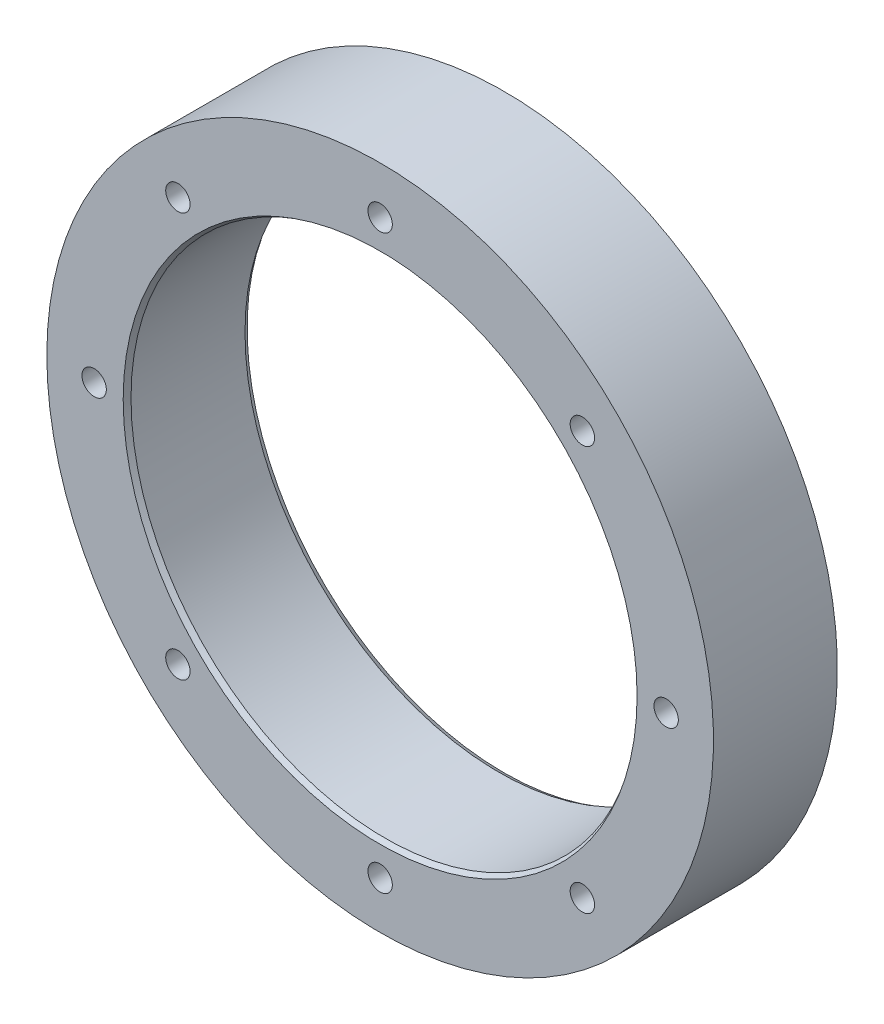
ISO-10303-21;
HEADER;
FILE_DESCRIPTION(('STEP AP214'),'2;1');
FILE_NAME('part.step','',(''),(''),'','','');
FILE_SCHEMA(('AUTOMOTIVE_DESIGN { 1 0 10303 214 1 1 1 1 }'));
ENDSEC;
DATA;
#1=APPLICATION_CONTEXT('core data for automotive mechanical design processes');
#2=APPLICATION_PROTOCOL_DEFINITION('international standard','automotive_design',2000,#1);
#3=PRODUCT_CONTEXT('',#1,'mechanical');
#4=PRODUCT('Part','Part','',(#3));
#5=PRODUCT_RELATED_PRODUCT_CATEGORY('part','',(#4));
#6=PRODUCT_DEFINITION_FORMATION('','',#4);
#7=PRODUCT_DEFINITION_CONTEXT('part definition',#1,'design');
#8=PRODUCT_DEFINITION('design','',#6,#7);
#9=PRODUCT_DEFINITION_SHAPE('','',#8);
#10=(LENGTH_UNIT() NAMED_UNIT(*) SI_UNIT(.MILLI.,.METRE.));
#11=(NAMED_UNIT(*) PLANE_ANGLE_UNIT() SI_UNIT($,.RADIAN.));
#12=(NAMED_UNIT(*) SI_UNIT($,.STERADIAN.) SOLID_ANGLE_UNIT());
#13=UNCERTAINTY_MEASURE_WITH_UNIT(LENGTH_MEASURE(1.E-05),#10,'distance_accuracy_value','');
#14=(GEOMETRIC_REPRESENTATION_CONTEXT(3) GLOBAL_UNCERTAINTY_ASSIGNED_CONTEXT((#13)) GLOBAL_UNIT_ASSIGNED_CONTEXT((#10,
#11,#12)) REPRESENTATION_CONTEXT('',''));
#15=CARTESIAN_POINT('',(0.,0.,0.));
#16=DIRECTION('',(0.,0.,1.));
#17=DIRECTION('',(1.,0.,0.));
#18=AXIS2_PLACEMENT_3D('',#15,#16,#17);
#19=CARTESIAN_POINT('',(-41.454135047,41.454135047,-13.4));
#20=DIRECTION('',(0.,0.,-1.));
#21=DIRECTION('',(0.,1.,0.));
#22=AXIS2_PLACEMENT_3D('',#19,#20,#21);
#23=CYLINDRICAL_SURFACE('',#22,2.5);
#24=CARTESIAN_POINT('',(-41.454135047,41.454135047,-13.4));
#25=DIRECTION('',(0.,0.,-1.));
#26=DIRECTION('',(0.,1.,0.));
#27=AXIS2_PLACEMENT_3D('',#24,#25,#26);
#28=CIRCLE('',#27,2.5);
#29=CARTESIAN_POINT('',(-41.454135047,43.954135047,-13.4));
#30=VERTEX_POINT('',#29);
#31=EDGE_CURVE('E31',#30,#30,#28,.T.);
#32=ORIENTED_EDGE('',*,*,#31,.F.);
#33=EDGE_LOOP('',(#32));
#34=FACE_BOUND('',#33,.T.);
#35=CARTESIAN_POINT('',(-41.454135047,41.454135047,-25.4));
#36=DIRECTION('',(0.,0.,-1.));
#37=DIRECTION('',(0.,1.,0.));
#38=AXIS2_PLACEMENT_3D('',#35,#36,#37);
#39=CIRCLE('',#38,2.5);
#40=CARTESIAN_POINT('',(-41.454135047,43.954135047,-25.4));
#41=VERTEX_POINT('',#40);
#42=EDGE_CURVE('E18',#41,#41,#39,.T.);
#43=ORIENTED_EDGE('',*,*,#42,.T.);
#44=EDGE_LOOP('',(#43));
#45=FACE_BOUND('',#44,.T.);
#46=ADVANCED_FACE('F14',(#34,#45),#23,.F.);
#47=CARTESIAN_POINT('',(-58.625,0.,-13.4));
#48=DIRECTION('',(0.,0.,-1.));
#49=DIRECTION('',(0.,1.,0.));
#50=AXIS2_PLACEMENT_3D('',#47,#48,#49);
#51=CYLINDRICAL_SURFACE('',#50,2.5);
#52=CARTESIAN_POINT('',(-58.625,0.,-13.4));
#53=DIRECTION('',(0.,0.,-1.));
#54=DIRECTION('',(-1.,0.,0.));
#55=AXIS2_PLACEMENT_3D('',#52,#53,#54);
#56=CIRCLE('',#55,2.5);
#57=CARTESIAN_POINT('',(-61.125,0.,-13.4));
#58=VERTEX_POINT('',#57);
#59=EDGE_CURVE('E113',#58,#58,#56,.T.);
#60=ORIENTED_EDGE('',*,*,#59,.F.);
#61=EDGE_LOOP('',(#60));
#62=FACE_BOUND('',#61,.T.);
#63=CARTESIAN_POINT('',(-58.625,0.,-25.4));
#64=DIRECTION('',(0.,0.,-1.));
#65=DIRECTION('',(0.,1.,0.));
#66=AXIS2_PLACEMENT_3D('',#63,#64,#65);
#67=CIRCLE('',#66,2.5);
#68=CARTESIAN_POINT('',(-58.625,2.5,-25.4));
#69=VERTEX_POINT('',#68);
#70=EDGE_CURVE('E87',#69,#69,#67,.T.);
#71=ORIENTED_EDGE('',*,*,#70,.T.);
#72=EDGE_LOOP('',(#71));
#73=FACE_BOUND('',#72,.T.);
#74=ADVANCED_FACE('F123',(#62,#73),#51,.F.);
#75=CARTESIAN_POINT('',(-41.454135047,-41.454135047,-13.4));
#76=DIRECTION('',(0.,0.,-1.));
#77=DIRECTION('',(0.,1.,0.));
#78=AXIS2_PLACEMENT_3D('',#75,#76,#77);
#79=CYLINDRICAL_SURFACE('',#78,2.5);
#80=CARTESIAN_POINT('',(-41.454135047,-41.454135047,-13.4));
#81=DIRECTION('',(0.,0.,-1.));
#82=DIRECTION('',(-1.,0.,0.));
#83=AXIS2_PLACEMENT_3D('',#80,#81,#82);
#84=CIRCLE('',#83,2.5);
#85=CARTESIAN_POINT('',(-43.954135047,-41.454135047,-13.4));
#86=VERTEX_POINT('',#85);
#87=EDGE_CURVE('E111',#86,#86,#84,.T.);
#88=ORIENTED_EDGE('',*,*,#87,.F.);
#89=EDGE_LOOP('',(#88));
#90=FACE_BOUND('',#89,.T.);
#91=CARTESIAN_POINT('',(-41.454135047,-41.454135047,-25.4));
#92=DIRECTION('',(0.,0.,-1.));
#93=DIRECTION('',(0.,1.,0.));
#94=AXIS2_PLACEMENT_3D('',#91,#92,#93);
#95=CIRCLE('',#94,2.5);
#96=CARTESIAN_POINT('',(-41.454135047,-38.954135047,-25.4));
#97=VERTEX_POINT('',#96);
#98=EDGE_CURVE('E85',#97,#97,#95,.T.);
#99=ORIENTED_EDGE('',*,*,#98,.T.);
#100=EDGE_LOOP('',(#99));
#101=FACE_BOUND('',#100,.T.);
#102=ADVANCED_FACE('F129',(#90,#101),#79,.F.);
#103=CARTESIAN_POINT('',(41.454135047,-41.454135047,-13.4));
#104=DIRECTION('',(0.,0.,-1.));
#105=DIRECTION('',(0.,1.,0.));
#106=AXIS2_PLACEMENT_3D('',#103,#104,#105);
#107=CYLINDRICAL_SURFACE('',#106,2.5);
#108=CARTESIAN_POINT('',(41.454135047,-41.454135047,-13.4));
#109=DIRECTION('',(0.,0.,-1.));
#110=DIRECTION('',(0.,1.,0.));
#111=AXIS2_PLACEMENT_3D('',#108,#109,#110);
#112=CIRCLE('',#111,2.5);
#113=CARTESIAN_POINT('',(41.454135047,-38.954135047,-13.4));
#114=VERTEX_POINT('',#113);
#115=EDGE_CURVE('E108',#114,#114,#112,.T.);
#116=ORIENTED_EDGE('',*,*,#115,.F.);
#117=EDGE_LOOP('',(#116));
#118=FACE_BOUND('',#117,.T.);
#119=CARTESIAN_POINT('',(41.454135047,-41.454135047,-25.4));
#120=DIRECTION('',(0.,0.,-1.));
#121=DIRECTION('',(0.,1.,0.));
#122=AXIS2_PLACEMENT_3D('',#119,#120,#121);
#123=CIRCLE('',#122,2.5);
#124=CARTESIAN_POINT('',(41.454135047,-38.954135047,-25.4));
#125=VERTEX_POINT('',#124);
#126=EDGE_CURVE('E82',#125,#125,#123,.T.);
#127=ORIENTED_EDGE('',*,*,#126,.T.);
#128=EDGE_LOOP('',(#127));
#129=FACE_BOUND('',#128,.T.);
#130=ADVANCED_FACE('F260',(#118,#129),#107,.F.);
#131=CARTESIAN_POINT('',(58.625,0.,-13.4));
#132=DIRECTION('',(0.,0.,-1.));
#133=DIRECTION('',(0.,1.,0.));
#134=AXIS2_PLACEMENT_3D('',#131,#132,#133);
#135=CYLINDRICAL_SURFACE('',#134,2.5);
#136=CARTESIAN_POINT('',(58.625,0.,-13.4));
#137=DIRECTION('',(0.,0.,-1.));
#138=DIRECTION('',(-1.,0.,0.));
#139=AXIS2_PLACEMENT_3D('',#136,#137,#138);
#140=CIRCLE('',#139,2.5);
#141=CARTESIAN_POINT('',(56.125,0.,-13.4));
#142=VERTEX_POINT('',#141);
#143=EDGE_CURVE('E101',#142,#142,#140,.T.);
#144=ORIENTED_EDGE('',*,*,#143,.F.);
#145=EDGE_LOOP('',(#144));
#146=FACE_BOUND('',#145,.T.);
#147=CARTESIAN_POINT('',(58.625,0.,-25.4));
#148=DIRECTION('',(0.,0.,-1.));
#149=DIRECTION('',(0.,1.,0.));
#150=AXIS2_PLACEMENT_3D('',#147,#148,#149);
#151=CIRCLE('',#150,2.5);
#152=CARTESIAN_POINT('',(58.625,2.50000000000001,-25.4));
#153=VERTEX_POINT('',#152);
#154=EDGE_CURVE('E79',#153,#153,#151,.T.);
#155=ORIENTED_EDGE('',*,*,#154,.T.);
#156=EDGE_LOOP('',(#155));
#157=FACE_BOUND('',#156,.T.);
#158=ADVANCED_FACE('F256',(#146,#157),#135,.F.);
#159=CARTESIAN_POINT('',(41.454135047,41.454135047,-13.4));
#160=DIRECTION('',(0.,0.,-1.));
#161=DIRECTION('',(0.,1.,0.));
#162=AXIS2_PLACEMENT_3D('',#159,#160,#161);
#163=CYLINDRICAL_SURFACE('',#162,2.5);
#164=CARTESIAN_POINT('',(41.454135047,41.454135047,-13.4));
#165=DIRECTION('',(0.,0.,-1.));
#166=DIRECTION('',(-1.,0.,0.));
#167=AXIS2_PLACEMENT_3D('',#164,#165,#166);
#168=CIRCLE('',#167,2.5);
#169=CARTESIAN_POINT('',(38.954135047,41.454135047,-13.4));
#170=VERTEX_POINT('',#169);
#171=EDGE_CURVE('E96',#170,#170,#168,.T.);
#172=ORIENTED_EDGE('',*,*,#171,.F.);
#173=EDGE_LOOP('',(#172));
#174=FACE_BOUND('',#173,.T.);
#175=CARTESIAN_POINT('',(41.454135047,41.454135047,-25.4));
#176=DIRECTION('',(0.,0.,-1.));
#177=DIRECTION('',(0.,1.,0.));
#178=AXIS2_PLACEMENT_3D('',#175,#176,#177);
#179=CIRCLE('',#178,2.5);
#180=CARTESIAN_POINT('',(41.454135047,43.954135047,-25.4));
#181=VERTEX_POINT('',#180);
#182=EDGE_CURVE('E76',#181,#181,#179,.T.);
#183=ORIENTED_EDGE('',*,*,#182,.T.);
#184=EDGE_LOOP('',(#183));
#185=FACE_BOUND('',#184,.T.);
#186=ADVANCED_FACE('F252',(#174,#185),#163,.F.);
#187=CARTESIAN_POINT('',(0.,58.625,-13.4));
#188=DIRECTION('',(0.,0.,-1.));
#189=DIRECTION('',(-1.,0.,0.));
#190=AXIS2_PLACEMENT_3D('',#187,#188,#189);
#191=CYLINDRICAL_SURFACE('',#190,2.5);
#192=CARTESIAN_POINT('',(0.,58.625,-13.4));
#193=DIRECTION('',(0.,0.,-1.));
#194=DIRECTION('',(-1.,0.,0.));
#195=AXIS2_PLACEMENT_3D('',#192,#193,#194);
#196=CIRCLE('',#195,2.5);
#197=CARTESIAN_POINT('',(-2.5,58.625,-13.4));
#198=VERTEX_POINT('',#197);
#199=EDGE_CURVE('E92',#198,#198,#196,.T.);
#200=ORIENTED_EDGE('',*,*,#199,.F.);
#201=EDGE_LOOP('',(#200));
#202=FACE_BOUND('',#201,.T.);
#203=CARTESIAN_POINT('',(0.,58.625,-25.4));
#204=DIRECTION('',(0.,0.,-1.));
#205=DIRECTION('',(-1.,0.,0.));
#206=AXIS2_PLACEMENT_3D('',#203,#204,#205);
#207=CIRCLE('',#206,2.5);
#208=CARTESIAN_POINT('',(-2.49999999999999,58.625,-25.4));
#209=VERTEX_POINT('',#208);
#210=EDGE_CURVE('E73',#209,#209,#207,.T.);
#211=ORIENTED_EDGE('',*,*,#210,.T.);
#212=EDGE_LOOP('',(#211));
#213=FACE_BOUND('',#212,.T.);
#214=ADVANCED_FACE('F248',(#202,#213),#191,.F.);
#215=CARTESIAN_POINT('',(-41.454135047,41.454135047,-12.7));
#216=DIRECTION('',(0.,0.,-1.));
#217=DIRECTION('',(-1.,0.,0.));
#218=AXIS2_PLACEMENT_3D('',#215,#216,#217);
#219=CONICAL_SURFACE('',#218,1.335004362,1.02974425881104);
#220=CARTESIAN_POINT('',(-41.454135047,41.454135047,-12.6999999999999));
#221=DIRECTION('',(0.,0.,1.));
#222=DIRECTION('',(1.,0.,0.));
#223=AXIS2_PLACEMENT_3D('',#220,#221,#222);
#224=CIRCLE('',#223,1.335004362);
#225=CARTESIAN_POINT('',(-40.119130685,41.454135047,-12.7));
#226=VERTEX_POINT('',#225);
#227=EDGE_CURVE('E72',#226,#226,#224,.F.);
#228=ORIENTED_EDGE('',*,*,#227,.F.);
#229=EDGE_LOOP('',(#228));
#230=FACE_BOUND('',#229,.T.);
#231=ORIENTED_EDGE('',*,*,#31,.T.);
#232=EDGE_LOOP('',(#231));
#233=FACE_BOUND('',#232,.T.);
#234=ADVANCED_FACE('F120',(#230,#233),#219,.F.);
#235=CARTESIAN_POINT('',(-58.625,0.,-12.7));
#236=DIRECTION('',(0.,0.,-1.));
#237=DIRECTION('',(-1.,0.,0.));
#238=AXIS2_PLACEMENT_3D('',#235,#236,#237);
#239=CONICAL_SURFACE('',#238,1.33500436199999,1.02974425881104);
#240=ORIENTED_EDGE('',*,*,#59,.T.);
#241=EDGE_LOOP('',(#240));
#242=FACE_BOUND('',#241,.T.);
#243=CARTESIAN_POINT('',(-58.625,0.,-12.6999999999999));
#244=DIRECTION('',(0.,0.,1.));
#245=DIRECTION('',(1.,0.,0.));
#246=AXIS2_PLACEMENT_3D('',#243,#244,#245);
#247=CIRCLE('',#246,1.335004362);
#248=CARTESIAN_POINT('',(-57.289995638,0.,-12.7));
#249=VERTEX_POINT('',#248);
#250=EDGE_CURVE('E338',#249,#249,#247,.F.);
#251=ORIENTED_EDGE('',*,*,#250,.F.);
#252=EDGE_LOOP('',(#251));
#253=FACE_BOUND('',#252,.T.);
#254=ADVANCED_FACE('F242',(#242,#253),#239,.F.);
#255=CARTESIAN_POINT('',(-41.454135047,-41.454135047,-12.7));
#256=DIRECTION('',(0.,0.,-1.));
#257=DIRECTION('',(-1.,0.,0.));
#258=AXIS2_PLACEMENT_3D('',#255,#256,#257);
#259=CONICAL_SURFACE('',#258,1.335004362,1.02974425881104);
#260=ORIENTED_EDGE('',*,*,#87,.T.);
#261=EDGE_LOOP('',(#260));
#262=FACE_BOUND('',#261,.T.);
#263=CARTESIAN_POINT('',(-41.454135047,-41.454135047,-12.6999999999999));
#264=DIRECTION('',(0.,0.,1.));
#265=DIRECTION('',(0.,-1.,0.));
#266=AXIS2_PLACEMENT_3D('',#263,#264,#265);
#267=CIRCLE('',#266,1.335004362);
#268=CARTESIAN_POINT('',(-41.454135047,-42.789139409,-12.7));
#269=VERTEX_POINT('',#268);
#270=EDGE_CURVE('E336',#269,#269,#267,.F.);
#271=ORIENTED_EDGE('',*,*,#270,.F.);
#272=EDGE_LOOP('',(#271));
#273=FACE_BOUND('',#272,.T.);
#274=ADVANCED_FACE('F238',(#262,#273),#259,.F.);
#275=CARTESIAN_POINT('',(41.454135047,-41.454135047,-12.7));
#276=DIRECTION('',(0.,0.,-1.));
#277=DIRECTION('',(-1.,0.,0.));
#278=AXIS2_PLACEMENT_3D('',#275,#276,#277);
#279=CONICAL_SURFACE('',#278,1.335004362,1.02974425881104);
#280=CARTESIAN_POINT('',(41.454135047,-41.454135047,-12.6999999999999));
#281=DIRECTION('',(0.,0.,1.));
#282=DIRECTION('',(1.,0.,0.));
#283=AXIS2_PLACEMENT_3D('',#280,#281,#282);
#284=CIRCLE('',#283,1.335004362);
#285=CARTESIAN_POINT('',(42.789139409,-41.454135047,-12.7));
#286=VERTEX_POINT('',#285);
#287=EDGE_CURVE('E333',#286,#286,#284,.F.);
#288=ORIENTED_EDGE('',*,*,#287,.F.);
#289=EDGE_LOOP('',(#288));
#290=FACE_BOUND('',#289,.T.);
#291=ORIENTED_EDGE('',*,*,#115,.T.);
#292=EDGE_LOOP('',(#291));
#293=FACE_BOUND('',#292,.T.);
#294=ADVANCED_FACE('F234',(#290,#293),#279,.F.);
#295=CARTESIAN_POINT('',(58.625,0.,-12.7));
#296=DIRECTION('',(0.,0.,-1.));
#297=DIRECTION('',(-1.,0.,0.));
#298=AXIS2_PLACEMENT_3D('',#295,#296,#297);
#299=CONICAL_SURFACE('',#298,1.335004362,1.02974425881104);
#300=ORIENTED_EDGE('',*,*,#143,.T.);
#301=EDGE_LOOP('',(#300));
#302=FACE_BOUND('',#301,.T.);
#303=CARTESIAN_POINT('',(58.625,0.,-12.6999999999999));
#304=DIRECTION('',(0.,0.,1.));
#305=DIRECTION('',(1.,0.,0.));
#306=AXIS2_PLACEMENT_3D('',#303,#304,#305);
#307=CIRCLE('',#306,1.33500436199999);
#308=CARTESIAN_POINT('',(59.960004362,0.,-12.7));
#309=VERTEX_POINT('',#308);
#310=EDGE_CURVE('E330',#309,#309,#307,.F.);
#311=ORIENTED_EDGE('',*,*,#310,.F.);
#312=EDGE_LOOP('',(#311));
#313=FACE_BOUND('',#312,.T.);
#314=ADVANCED_FACE('F230',(#302,#313),#299,.F.);
#315=CARTESIAN_POINT('',(41.454135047,41.454135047,-12.7));
#316=DIRECTION('',(0.,0.,-1.));
#317=DIRECTION('',(-1.,0.,0.));
#318=AXIS2_PLACEMENT_3D('',#315,#316,#317);
#319=CONICAL_SURFACE('',#318,1.335004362,1.02974425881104);
#320=ORIENTED_EDGE('',*,*,#171,.T.);
#321=EDGE_LOOP('',(#320));
#322=FACE_BOUND('',#321,.T.);
#323=CARTESIAN_POINT('',(41.454135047,41.454135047,-12.6999999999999));
#324=DIRECTION('',(0.,0.,1.));
#325=DIRECTION('',(0.,-1.,0.));
#326=AXIS2_PLACEMENT_3D('',#323,#324,#325);
#327=CIRCLE('',#326,1.335004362);
#328=CARTESIAN_POINT('',(41.454135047,40.119130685,-12.7));
#329=VERTEX_POINT('',#328);
#330=EDGE_CURVE('E327',#329,#329,#327,.F.);
#331=ORIENTED_EDGE('',*,*,#330,.F.);
#332=EDGE_LOOP('',(#331));
#333=FACE_BOUND('',#332,.T.);
#334=ADVANCED_FACE('F227',(#322,#333),#319,.F.);
#335=CARTESIAN_POINT('',(0.,58.625,-12.7));
#336=DIRECTION('',(0.,0.,-1.));
#337=DIRECTION('',(-1.,0.,0.));
#338=AXIS2_PLACEMENT_3D('',#335,#336,#337);
#339=CONICAL_SURFACE('',#338,1.335004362,1.02974425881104);
#340=ORIENTED_EDGE('',*,*,#199,.T.);
#341=EDGE_LOOP('',(#340));
#342=FACE_BOUND('',#341,.T.);
#343=CARTESIAN_POINT('',(0.,58.625,-12.6999999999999));
#344=DIRECTION('',(0.,0.,1.));
#345=DIRECTION('',(0.,-1.,0.));
#346=AXIS2_PLACEMENT_3D('',#343,#344,#345);
#347=CIRCLE('',#346,1.335004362);
#348=CARTESIAN_POINT('',(0.,57.289995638,-12.7));
#349=VERTEX_POINT('',#348);
#350=EDGE_CURVE('E324',#349,#349,#347,.F.);
#351=ORIENTED_EDGE('',*,*,#350,.F.);
#352=EDGE_LOOP('',(#351));
#353=FACE_BOUND('',#352,.T.);
#354=ADVANCED_FACE('F223',(#342,#353),#339,.F.);
#355=CARTESIAN_POINT('',(0.,0.,-24.383981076));
#356=DIRECTION('',(0.,0.,-1.));
#357=DIRECTION('',(0.,1.,0.));
#358=AXIS2_PLACEMENT_3D('',#355,#356,#357);
#359=CONICAL_SURFACE('',#358,52.085,0.52359886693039);
#360=CARTESIAN_POINT('',(0.,0.,-25.4000000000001));
#361=DIRECTION('',(0.,0.,-1.));
#362=DIRECTION('',(0.,1.,0.));
#363=AXIS2_PLACEMENT_3D('',#360,#361,#362);
#364=CIRCLE('',#363,52.6715989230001);
#365=CARTESIAN_POINT('',(0.,52.6715989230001,-25.4000000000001));
#366=VERTEX_POINT('',#365);
#367=EDGE_CURVE('E69',#366,#366,#364,.T.);
#368=ORIENTED_EDGE('',*,*,#367,.T.);
#369=EDGE_LOOP('',(#368));
#370=FACE_BOUND('',#369,.T.);
#371=CARTESIAN_POINT('',(0.,0.,-24.383981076));
#372=DIRECTION('',(0.,0.,-1.));
#373=DIRECTION('',(-1.,0.,0.));
#374=AXIS2_PLACEMENT_3D('',#371,#372,#373);
#375=CIRCLE('',#374,52.085);
#376=CARTESIAN_POINT('',(-52.085,0.,-24.383981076));
#377=VERTEX_POINT('',#376);
#378=EDGE_CURVE('E68',#377,#377,#375,.T.);
#379=ORIENTED_EDGE('',*,*,#378,.F.);
#380=EDGE_LOOP('',(#379));
#381=FACE_BOUND('',#380,.T.);
#382=ADVANCED_FACE('F220',(#370,#381),#359,.F.);
#383=CARTESIAN_POINT('',(69.1449,-69.1449,-25.4));
#384=DIRECTION('',(0.,0.,1.));
#385=DIRECTION('',(0.,1.,0.));
#386=AXIS2_PLACEMENT_3D('',#383,#384,#385);
#387=PLANE('',#386);
#388=ORIENTED_EDGE('',*,*,#367,.F.);
#389=EDGE_LOOP('',(#388));
#390=FACE_BOUND('',#389,.T.);
#391=ORIENTED_EDGE('',*,*,#210,.F.);
#392=EDGE_LOOP('',(#391));
#393=FACE_BOUND('',#392,.T.);
#394=ORIENTED_EDGE('',*,*,#182,.F.);
#395=EDGE_LOOP('',(#394));
#396=FACE_BOUND('',#395,.T.);
#397=ORIENTED_EDGE('',*,*,#154,.F.);
#398=EDGE_LOOP('',(#397));
#399=FACE_BOUND('',#398,.T.);
#400=ORIENTED_EDGE('',*,*,#126,.F.);
#401=EDGE_LOOP('',(#400));
#402=FACE_BOUND('',#401,.T.);
#403=CARTESIAN_POINT('',(0.,-58.625,-25.4));
#404=DIRECTION('',(0.,0.,-1.));
#405=DIRECTION('',(-1.,0.,0.));
#406=AXIS2_PLACEMENT_3D('',#403,#404,#405);
#407=CIRCLE('',#406,2.5);
#408=CARTESIAN_POINT('',(-2.5,-58.625,-25.4));
#409=VERTEX_POINT('',#408);
#410=EDGE_CURVE('E65',#409,#409,#407,.T.);
#411=ORIENTED_EDGE('',*,*,#410,.F.);
#412=EDGE_LOOP('',(#411));
#413=FACE_BOUND('',#412,.T.);
#414=ORIENTED_EDGE('',*,*,#98,.F.);
#415=EDGE_LOOP('',(#414));
#416=FACE_BOUND('',#415,.T.);
#417=ORIENTED_EDGE('',*,*,#70,.F.);
#418=EDGE_LOOP('',(#417));
#419=FACE_BOUND('',#418,.T.);
#420=ORIENTED_EDGE('',*,*,#42,.F.);
#421=EDGE_LOOP('',(#420));
#422=FACE_BOUND('',#421,.T.);
#423=CARTESIAN_POINT('',(0.,0.,-25.4));
#424=DIRECTION('',(0.,0.,-1.));
#425=DIRECTION('',(-1.,0.,0.));
#426=AXIS2_PLACEMENT_3D('',#423,#424,#425);
#427=CIRCLE('',#426,68.325);
#428=CARTESIAN_POINT('',(-68.325,0.,-25.4));
#429=VERTEX_POINT('',#428);
#430=EDGE_CURVE('E61',#429,#429,#427,.T.);
#431=ORIENTED_EDGE('',*,*,#430,.T.);
#432=EDGE_LOOP('',(#431));
#433=FACE_BOUND('',#432,.T.);
#434=ADVANCED_FACE('F218',(#390,#393,#396,#399,#402,#413,#416,#419,#422,#433),#387,.F.);
#435=CARTESIAN_POINT('',(-41.454135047,41.454135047,-12.7));
#436=DIRECTION('',(0.,0.,1.));
#437=DIRECTION('',(1.,0.,0.));
#438=AXIS2_PLACEMENT_3D('',#435,#436,#437);
#439=CONICAL_SURFACE('',#438,1.335004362,1.02974425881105);
#440=CARTESIAN_POINT('',(-41.454135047,41.454135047,-12.));
#441=DIRECTION('',(0.,0.,1.));
#442=DIRECTION('',(1.,0.,0.));
#443=AXIS2_PLACEMENT_3D('',#440,#441,#442);
#444=CIRCLE('',#443,2.5);
#445=CARTESIAN_POINT('',(-38.954135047,41.454135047,-12.));
#446=VERTEX_POINT('',#445);
#447=EDGE_CURVE('E64',#446,#446,#444,.F.);
#448=ORIENTED_EDGE('',*,*,#447,.F.);
#449=EDGE_LOOP('',(#448));
#450=FACE_BOUND('',#449,.T.);
#451=ORIENTED_EDGE('',*,*,#227,.T.);
#452=EDGE_LOOP('',(#451));
#453=FACE_BOUND('',#452,.T.);
#454=ADVANCED_FACE('F214',(#450,#453),#439,.F.);
#455=CARTESIAN_POINT('',(-58.625,0.,-12.7));
#456=DIRECTION('',(0.,0.,1.));
#457=DIRECTION('',(1.,0.,0.));
#458=AXIS2_PLACEMENT_3D('',#455,#456,#457);
#459=CONICAL_SURFACE('',#458,1.335004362,1.02974425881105);
#460=CARTESIAN_POINT('',(-58.625,0.,-12.));
#461=DIRECTION('',(0.,0.,1.));
#462=DIRECTION('',(1.,0.,0.));
#463=AXIS2_PLACEMENT_3D('',#460,#461,#462);
#464=CIRCLE('',#463,2.5);
#465=CARTESIAN_POINT('',(-56.125,0.,-12.));
#466=VERTEX_POINT('',#465);
#467=EDGE_CURVE('E317',#466,#466,#464,.F.);
#468=ORIENTED_EDGE('',*,*,#467,.F.);
#469=EDGE_LOOP('',(#468));
#470=FACE_BOUND('',#469,.T.);
#471=ORIENTED_EDGE('',*,*,#250,.T.);
#472=EDGE_LOOP('',(#471));
#473=FACE_BOUND('',#472,.T.);
#474=ADVANCED_FACE('F210',(#470,#473),#459,.F.);
#475=CARTESIAN_POINT('',(-41.454135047,-41.454135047,-12.7));
#476=DIRECTION('',(0.,0.,1.));
#477=DIRECTION('',(1.,0.,0.));
#478=AXIS2_PLACEMENT_3D('',#475,#476,#477);
#479=CONICAL_SURFACE('',#478,1.335004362,1.02974425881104);
#480=CARTESIAN_POINT('',(-41.454135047,-41.454135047,-12.));
#481=DIRECTION('',(0.,0.,1.));
#482=DIRECTION('',(0.,-1.,0.));
#483=AXIS2_PLACEMENT_3D('',#480,#481,#482);
#484=CIRCLE('',#483,2.5);
#485=CARTESIAN_POINT('',(-41.454135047,-43.954135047,-12.));
#486=VERTEX_POINT('',#485);
#487=EDGE_CURVE('E314',#486,#486,#484,.F.);
#488=ORIENTED_EDGE('',*,*,#487,.F.);
#489=EDGE_LOOP('',(#488));
#490=FACE_BOUND('',#489,.T.);
#491=ORIENTED_EDGE('',*,*,#270,.T.);
#492=EDGE_LOOP('',(#491));
#493=FACE_BOUND('',#492,.T.);
#494=ADVANCED_FACE('F206',(#490,#493),#479,.F.);
#495=CARTESIAN_POINT('',(41.454135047,-41.454135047,-12.7));
#496=DIRECTION('',(0.,0.,1.));
#497=DIRECTION('',(1.,0.,0.));
#498=AXIS2_PLACEMENT_3D('',#495,#496,#497);
#499=CONICAL_SURFACE('',#498,1.335004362,1.02974425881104);
#500=CARTESIAN_POINT('',(41.454135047,-41.454135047,-12.));
#501=DIRECTION('',(0.,0.,1.));
#502=DIRECTION('',(1.,0.,0.));
#503=AXIS2_PLACEMENT_3D('',#500,#501,#502);
#504=CIRCLE('',#503,2.5);
#505=CARTESIAN_POINT('',(43.954135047,-41.454135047,-12.));
#506=VERTEX_POINT('',#505);
#507=EDGE_CURVE('E311',#506,#506,#504,.F.);
#508=ORIENTED_EDGE('',*,*,#507,.F.);
#509=EDGE_LOOP('',(#508));
#510=FACE_BOUND('',#509,.T.);
#511=ORIENTED_EDGE('',*,*,#287,.T.);
#512=EDGE_LOOP('',(#511));
#513=FACE_BOUND('',#512,.T.);
#514=ADVANCED_FACE('F202',(#510,#513),#499,.F.);
#515=CARTESIAN_POINT('',(58.625,0.,-12.7));
#516=DIRECTION('',(0.,0.,1.));
#517=DIRECTION('',(1.,0.,0.));
#518=AXIS2_PLACEMENT_3D('',#515,#516,#517);
#519=CONICAL_SURFACE('',#518,1.33500436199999,1.02974425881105);
#520=CARTESIAN_POINT('',(58.625,0.,-12.));
#521=DIRECTION('',(0.,0.,1.));
#522=DIRECTION('',(1.,0.,0.));
#523=AXIS2_PLACEMENT_3D('',#520,#521,#522);
#524=CIRCLE('',#523,2.5);
#525=CARTESIAN_POINT('',(61.125,0.,-12.));
#526=VERTEX_POINT('',#525);
#527=EDGE_CURVE('E308',#526,#526,#524,.F.);
#528=ORIENTED_EDGE('',*,*,#527,.F.);
#529=EDGE_LOOP('',(#528));
#530=FACE_BOUND('',#529,.T.);
#531=ORIENTED_EDGE('',*,*,#310,.T.);
#532=EDGE_LOOP('',(#531));
#533=FACE_BOUND('',#532,.T.);
#534=ADVANCED_FACE('F198',(#530,#533),#519,.F.);
#535=CARTESIAN_POINT('',(41.454135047,41.454135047,-12.7));
#536=DIRECTION('',(0.,0.,1.));
#537=DIRECTION('',(1.,0.,0.));
#538=AXIS2_PLACEMENT_3D('',#535,#536,#537);
#539=CONICAL_SURFACE('',#538,1.335004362,1.02974425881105);
#540=CARTESIAN_POINT('',(41.454135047,41.454135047,-12.));
#541=DIRECTION('',(0.,0.,1.));
#542=DIRECTION('',(0.,-1.,0.));
#543=AXIS2_PLACEMENT_3D('',#540,#541,#542);
#544=CIRCLE('',#543,2.5);
#545=CARTESIAN_POINT('',(41.454135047,38.954135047,-12.));
#546=VERTEX_POINT('',#545);
#547=EDGE_CURVE('E305',#546,#546,#544,.F.);
#548=ORIENTED_EDGE('',*,*,#547,.F.);
#549=EDGE_LOOP('',(#548));
#550=FACE_BOUND('',#549,.T.);
#551=ORIENTED_EDGE('',*,*,#330,.T.);
#552=EDGE_LOOP('',(#551));
#553=FACE_BOUND('',#552,.T.);
#554=ADVANCED_FACE('F194',(#550,#553),#539,.F.);
#555=CARTESIAN_POINT('',(0.,58.625,-12.7));
#556=DIRECTION('',(0.,0.,1.));
#557=DIRECTION('',(1.,0.,0.));
#558=AXIS2_PLACEMENT_3D('',#555,#556,#557);
#559=CONICAL_SURFACE('',#558,1.335004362,1.02974425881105);
#560=ORIENTED_EDGE('',*,*,#350,.T.);
#561=EDGE_LOOP('',(#560));
#562=FACE_BOUND('',#561,.T.);
#563=CARTESIAN_POINT('',(0.,58.625,-12.));
#564=DIRECTION('',(0.,0.,1.));
#565=DIRECTION('',(1.,0.,0.));
#566=AXIS2_PLACEMENT_3D('',#563,#564,#565);
#567=CIRCLE('',#566,2.5);
#568=CARTESIAN_POINT('',(2.5,58.625,-12.));
#569=VERTEX_POINT('',#568);
#570=EDGE_CURVE('E299',#569,#569,#567,.F.);
#571=ORIENTED_EDGE('',*,*,#570,.F.);
#572=EDGE_LOOP('',(#571));
#573=FACE_BOUND('',#572,.T.);
#574=ADVANCED_FACE('F190',(#562,#573),#559,.F.);
#575=CARTESIAN_POINT('',(0.,0.,-1.016021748));
#576=DIRECTION('',(0.,0.,-1.));
#577=DIRECTION('',(-1.,0.,0.));
#578=AXIS2_PLACEMENT_3D('',#575,#576,#577);
#579=CYLINDRICAL_SURFACE('',#578,52.085);
#580=ORIENTED_EDGE('',*,*,#378,.T.);
#581=EDGE_LOOP('',(#580));
#582=FACE_BOUND('',#581,.T.);
#583=CARTESIAN_POINT('',(0.,0.,-1.01602174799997));
#584=DIRECTION('',(0.,0.,1.));
#585=DIRECTION('',(1.,0.,0.));
#586=AXIS2_PLACEMENT_3D('',#583,#584,#585);
#587=CIRCLE('',#586,52.085);
#588=CARTESIAN_POINT('',(52.085,0.,-1.016021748));
#589=VERTEX_POINT('',#588);
#590=EDGE_CURVE('E296',#589,#589,#587,.F.);
#591=ORIENTED_EDGE('',*,*,#590,.F.);
#592=EDGE_LOOP('',(#591));
#593=FACE_BOUND('',#592,.T.);
#594=ADVANCED_FACE('F186',(#582,#593),#579,.F.);
#595=CARTESIAN_POINT('',(0.,-58.625,-13.4));
#596=DIRECTION('',(0.,0.,-1.));
#597=DIRECTION('',(-1.,0.,0.));
#598=AXIS2_PLACEMENT_3D('',#595,#596,#597);
#599=CYLINDRICAL_SURFACE('',#598,2.5);
#600=ORIENTED_EDGE('',*,*,#410,.T.);
#601=EDGE_LOOP('',(#600));
#602=FACE_BOUND('',#601,.T.);
#603=CARTESIAN_POINT('',(0.,-58.625,-13.4));
#604=DIRECTION('',(0.,0.,-1.));
#605=DIRECTION('',(-1.,0.,0.));
#606=AXIS2_PLACEMENT_3D('',#603,#604,#605);
#607=CIRCLE('',#606,2.5);
#608=CARTESIAN_POINT('',(-2.5,-58.625,-13.4));
#609=VERTEX_POINT('',#608);
#610=EDGE_CURVE('E60',#609,#609,#607,.T.);
#611=ORIENTED_EDGE('',*,*,#610,.F.);
#612=EDGE_LOOP('',(#611));
#613=FACE_BOUND('',#612,.T.);
#614=ADVANCED_FACE('F182',(#602,#613),#599,.F.);
#615=CARTESIAN_POINT('',(0.,0.,0.));
#616=DIRECTION('',(0.,0.,-1.));
#617=DIRECTION('',(-1.,0.,0.));
#618=AXIS2_PLACEMENT_3D('',#615,#616,#617);
#619=CYLINDRICAL_SURFACE('',#618,68.325);
#620=CARTESIAN_POINT('',(0.,0.,0.));
#621=DIRECTION('',(0.,0.,-1.));
#622=DIRECTION('',(-1.,0.,0.));
#623=AXIS2_PLACEMENT_3D('',#620,#621,#622);
#624=CIRCLE('',#623,68.325);
#625=CARTESIAN_POINT('',(-68.325,0.,0.));
#626=VERTEX_POINT('',#625);
#627=EDGE_CURVE('E57',#626,#626,#624,.F.);
#628=ORIENTED_EDGE('',*,*,#627,.F.);
#629=EDGE_LOOP('',(#628));
#630=FACE_BOUND('',#629,.T.);
#631=ORIENTED_EDGE('',*,*,#430,.F.);
#632=EDGE_LOOP('',(#631));
#633=FACE_BOUND('',#632,.T.);
#634=ADVANCED_FACE('F178',(#630,#633),#619,.T.);
#635=CARTESIAN_POINT('',(-41.454135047,41.454135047,-12.));
#636=DIRECTION('',(0.,0.,1.));
#637=DIRECTION('',(1.,0.,0.));
#638=AXIS2_PLACEMENT_3D('',#635,#636,#637);
#639=CYLINDRICAL_SURFACE('',#638,2.5);
#640=CARTESIAN_POINT('',(-41.454135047,41.454135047,0.));
#641=DIRECTION('',(0.,0.,1.));
#642=DIRECTION('',(1.,0.,0.));
#643=AXIS2_PLACEMENT_3D('',#640,#641,#642);
#644=CIRCLE('',#643,2.5);
#645=CARTESIAN_POINT('',(-38.954135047,41.454135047,0.));
#646=VERTEX_POINT('',#645);
#647=EDGE_CURVE('E54',#646,#646,#644,.F.);
#648=ORIENTED_EDGE('',*,*,#647,.F.);
#649=EDGE_LOOP('',(#648));
#650=FACE_BOUND('',#649,.T.);
#651=ORIENTED_EDGE('',*,*,#447,.T.);
#652=EDGE_LOOP('',(#651));
#653=FACE_BOUND('',#652,.T.);
#654=ADVANCED_FACE('F174',(#650,#653),#639,.F.);
#655=CARTESIAN_POINT('',(-58.625,0.,-12.));
#656=DIRECTION('',(0.,0.,1.));
#657=DIRECTION('',(1.,0.,0.));
#658=AXIS2_PLACEMENT_3D('',#655,#656,#657);
#659=CYLINDRICAL_SURFACE('',#658,2.5);
#660=CARTESIAN_POINT('',(-58.625,0.,0.));
#661=DIRECTION('',(0.,0.,1.));
#662=DIRECTION('',(1.,0.,0.));
#663=AXIS2_PLACEMENT_3D('',#660,#661,#662);
#664=CIRCLE('',#663,2.5);
#665=CARTESIAN_POINT('',(-56.125,0.,0.));
#666=VERTEX_POINT('',#665);
#667=EDGE_CURVE('E51',#666,#666,#664,.F.);
#668=ORIENTED_EDGE('',*,*,#667,.F.);
#669=EDGE_LOOP('',(#668));
#670=FACE_BOUND('',#669,.T.);
#671=ORIENTED_EDGE('',*,*,#467,.T.);
#672=EDGE_LOOP('',(#671));
#673=FACE_BOUND('',#672,.T.);
#674=ADVANCED_FACE('F170',(#670,#673),#659,.F.);
#675=CARTESIAN_POINT('',(-41.454135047,-41.454135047,-12.));
#676=DIRECTION('',(0.,0.,1.));
#677=DIRECTION('',(1.,0.,0.));
#678=AXIS2_PLACEMENT_3D('',#675,#676,#677);
#679=CYLINDRICAL_SURFACE('',#678,2.5);
#680=CARTESIAN_POINT('',(-41.454135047,-41.454135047,0.));
#681=DIRECTION('',(0.,0.,1.));
#682=DIRECTION('',(1.,0.,0.));
#683=AXIS2_PLACEMENT_3D('',#680,#681,#682);
#684=CIRCLE('',#683,2.5);
#685=CARTESIAN_POINT('',(-38.954135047,-41.454135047,0.));
#686=VERTEX_POINT('',#685);
#687=EDGE_CURVE('E48',#686,#686,#684,.F.);
#688=ORIENTED_EDGE('',*,*,#687,.F.);
#689=EDGE_LOOP('',(#688));
#690=FACE_BOUND('',#689,.T.);
#691=ORIENTED_EDGE('',*,*,#487,.T.);
#692=EDGE_LOOP('',(#691));
#693=FACE_BOUND('',#692,.T.);
#694=ADVANCED_FACE('F166',(#690,#693),#679,.F.);
#695=CARTESIAN_POINT('',(41.454135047,-41.454135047,-12.));
#696=DIRECTION('',(0.,0.,1.));
#697=DIRECTION('',(1.,0.,0.));
#698=AXIS2_PLACEMENT_3D('',#695,#696,#697);
#699=CYLINDRICAL_SURFACE('',#698,2.5);
#700=CARTESIAN_POINT('',(41.454135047,-41.454135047,0.));
#701=DIRECTION('',(0.,0.,1.));
#702=DIRECTION('',(1.,0.,0.));
#703=AXIS2_PLACEMENT_3D('',#700,#701,#702);
#704=CIRCLE('',#703,2.5);
#705=CARTESIAN_POINT('',(43.954135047,-41.454135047,0.));
#706=VERTEX_POINT('',#705);
#707=EDGE_CURVE('E45',#706,#706,#704,.F.);
#708=ORIENTED_EDGE('',*,*,#707,.F.);
#709=EDGE_LOOP('',(#708));
#710=FACE_BOUND('',#709,.T.);
#711=ORIENTED_EDGE('',*,*,#507,.T.);
#712=EDGE_LOOP('',(#711));
#713=FACE_BOUND('',#712,.T.);
#714=ADVANCED_FACE('F162',(#710,#713),#699,.F.);
#715=CARTESIAN_POINT('',(58.625,0.,-12.));
#716=DIRECTION('',(0.,0.,1.));
#717=DIRECTION('',(1.,0.,0.));
#718=AXIS2_PLACEMENT_3D('',#715,#716,#717);
#719=CYLINDRICAL_SURFACE('',#718,2.5);
#720=CARTESIAN_POINT('',(58.625,0.,0.));
#721=DIRECTION('',(0.,0.,1.));
#722=DIRECTION('',(1.,0.,0.));
#723=AXIS2_PLACEMENT_3D('',#720,#721,#722);
#724=CIRCLE('',#723,2.5);
#725=CARTESIAN_POINT('',(61.125,0.,0.));
#726=VERTEX_POINT('',#725);
#727=EDGE_CURVE('E42',#726,#726,#724,.F.);
#728=ORIENTED_EDGE('',*,*,#727,.F.);
#729=EDGE_LOOP('',(#728));
#730=FACE_BOUND('',#729,.T.);
#731=ORIENTED_EDGE('',*,*,#527,.T.);
#732=EDGE_LOOP('',(#731));
#733=FACE_BOUND('',#732,.T.);
#734=ADVANCED_FACE('F158',(#730,#733),#719,.F.);
#735=CARTESIAN_POINT('',(41.454135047,41.454135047,-12.));
#736=DIRECTION('',(0.,0.,1.));
#737=DIRECTION('',(1.,0.,0.));
#738=AXIS2_PLACEMENT_3D('',#735,#736,#737);
#739=CYLINDRICAL_SURFACE('',#738,2.5);
#740=CARTESIAN_POINT('',(41.454135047,41.454135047,0.));
#741=DIRECTION('',(0.,0.,1.));
#742=DIRECTION('',(1.,0.,0.));
#743=AXIS2_PLACEMENT_3D('',#740,#741,#742);
#744=CIRCLE('',#743,2.5);
#745=CARTESIAN_POINT('',(43.954135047,41.454135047,0.));
#746=VERTEX_POINT('',#745);
#747=EDGE_CURVE('E39',#746,#746,#744,.F.);
#748=ORIENTED_EDGE('',*,*,#747,.F.);
#749=EDGE_LOOP('',(#748));
#750=FACE_BOUND('',#749,.T.);
#751=ORIENTED_EDGE('',*,*,#547,.T.);
#752=EDGE_LOOP('',(#751));
#753=FACE_BOUND('',#752,.T.);
#754=ADVANCED_FACE('F154',(#750,#753),#739,.F.);
#755=CARTESIAN_POINT('',(0.,58.625,-12.));
#756=DIRECTION('',(0.,0.,1.));
#757=DIRECTION('',(1.,0.,0.));
#758=AXIS2_PLACEMENT_3D('',#755,#756,#757);
#759=CYLINDRICAL_SURFACE('',#758,2.5);
#760=CARTESIAN_POINT('',(0.,58.625,0.));
#761=DIRECTION('',(0.,0.,1.));
#762=DIRECTION('',(1.,0.,0.));
#763=AXIS2_PLACEMENT_3D('',#760,#761,#762);
#764=CIRCLE('',#763,2.5);
#765=CARTESIAN_POINT('',(2.5,58.625,0.));
#766=VERTEX_POINT('',#765);
#767=EDGE_CURVE('E36',#766,#766,#764,.F.);
#768=ORIENTED_EDGE('',*,*,#767,.F.);
#769=EDGE_LOOP('',(#768));
#770=FACE_BOUND('',#769,.T.);
#771=ORIENTED_EDGE('',*,*,#570,.T.);
#772=EDGE_LOOP('',(#771));
#773=FACE_BOUND('',#772,.T.);
#774=ADVANCED_FACE('F150',(#770,#773),#759,.F.);
#775=CARTESIAN_POINT('',(0.,0.,-1.016021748));
#776=DIRECTION('',(0.,0.,1.));
#777=DIRECTION('',(1.,0.,0.));
#778=AXIS2_PLACEMENT_3D('',#775,#776,#777);
#779=CONICAL_SURFACE('',#778,52.085,0.523598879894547);
#780=CARTESIAN_POINT('',(0.,0.,0.));
#781=DIRECTION('',(0.,0.,1.));
#782=DIRECTION('',(1.,0.,0.));
#783=AXIS2_PLACEMENT_3D('',#780,#781,#782);
#784=CIRCLE('',#783,52.671600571);
#785=CARTESIAN_POINT('',(52.671600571,0.,0.));
#786=VERTEX_POINT('',#785);
#787=EDGE_CURVE('E33',#786,#786,#784,.F.);
#788=ORIENTED_EDGE('',*,*,#787,.F.);
#789=EDGE_LOOP('',(#788));
#790=FACE_BOUND('',#789,.T.);
#791=ORIENTED_EDGE('',*,*,#590,.T.);
#792=EDGE_LOOP('',(#791));
#793=FACE_BOUND('',#792,.T.);
#794=ADVANCED_FACE('F146',(#790,#793),#779,.F.);
#795=CARTESIAN_POINT('',(0.,-58.625,-12.7));
#796=DIRECTION('',(0.,0.,-1.));
#797=DIRECTION('',(-1.,0.,0.));
#798=AXIS2_PLACEMENT_3D('',#795,#796,#797);
#799=CONICAL_SURFACE('',#798,1.335004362,1.02974425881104);
#800=ORIENTED_EDGE('',*,*,#610,.T.);
#801=EDGE_LOOP('',(#800));
#802=FACE_BOUND('',#801,.T.);
#803=CARTESIAN_POINT('',(0.,-58.625,-12.6999999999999));
#804=DIRECTION('',(0.,0.,1.));
#805=DIRECTION('',(0.,-1.,0.));
#806=AXIS2_PLACEMENT_3D('',#803,#804,#805);
#807=CIRCLE('',#806,1.33500436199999);
#808=CARTESIAN_POINT('',(0.,-59.960004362,-12.7));
#809=VERTEX_POINT('',#808);
#810=EDGE_CURVE('E27',#809,#809,#807,.F.);
#811=ORIENTED_EDGE('',*,*,#810,.F.);
#812=EDGE_LOOP('',(#811));
#813=FACE_BOUND('',#812,.T.);
#814=ADVANCED_FACE('F143',(#802,#813),#799,.F.);
#815=CARTESIAN_POINT('',(69.1449,-69.1449,0.));
#816=DIRECTION('',(0.,0.,1.));
#817=DIRECTION('',(0.,1.,0.));
#818=AXIS2_PLACEMENT_3D('',#815,#816,#817);
#819=PLANE('',#818);
#820=ORIENTED_EDGE('',*,*,#787,.T.);
#821=EDGE_LOOP('',(#820));
#822=FACE_BOUND('',#821,.T.);
#823=ORIENTED_EDGE('',*,*,#767,.T.);
#824=EDGE_LOOP('',(#823));
#825=FACE_BOUND('',#824,.T.);
#826=ORIENTED_EDGE('',*,*,#747,.T.);
#827=EDGE_LOOP('',(#826));
#828=FACE_BOUND('',#827,.T.);
#829=ORIENTED_EDGE('',*,*,#727,.T.);
#830=EDGE_LOOP('',(#829));
#831=FACE_BOUND('',#830,.T.);
#832=ORIENTED_EDGE('',*,*,#707,.T.);
#833=EDGE_LOOP('',(#832));
#834=FACE_BOUND('',#833,.T.);
#835=CARTESIAN_POINT('',(0.,-58.625,0.));
#836=DIRECTION('',(0.,0.,1.));
#837=DIRECTION('',(1.,0.,0.));
#838=AXIS2_PLACEMENT_3D('',#835,#836,#837);
#839=CIRCLE('',#838,2.5);
#840=CARTESIAN_POINT('',(2.5,-58.625,0.));
#841=VERTEX_POINT('',#840);
#842=EDGE_CURVE('E10',#841,#841,#839,.T.);
#843=ORIENTED_EDGE('',*,*,#842,.F.);
#844=EDGE_LOOP('',(#843));
#845=FACE_BOUND('',#844,.T.);
#846=ORIENTED_EDGE('',*,*,#687,.T.);
#847=EDGE_LOOP('',(#846));
#848=FACE_BOUND('',#847,.T.);
#849=ORIENTED_EDGE('',*,*,#667,.T.);
#850=EDGE_LOOP('',(#849));
#851=FACE_BOUND('',#850,.T.);
#852=ORIENTED_EDGE('',*,*,#647,.T.);
#853=EDGE_LOOP('',(#852));
#854=FACE_BOUND('',#853,.T.);
#855=ORIENTED_EDGE('',*,*,#627,.T.);
#856=EDGE_LOOP('',(#855));
#857=FACE_BOUND('',#856,.T.);
#858=ADVANCED_FACE('F16',(#822,#825,#828,#831,#834,#845,#848,#851,#854,#857),#819,.T.);
#859=CARTESIAN_POINT('',(0.,-58.625,-12.7));
#860=DIRECTION('',(0.,0.,1.));
#861=DIRECTION('',(1.,0.,0.));
#862=AXIS2_PLACEMENT_3D('',#859,#860,#861);
#863=CONICAL_SURFACE('',#862,1.33500436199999,1.02974425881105);
#864=ORIENTED_EDGE('',*,*,#810,.T.);
#865=EDGE_LOOP('',(#864));
#866=FACE_BOUND('',#865,.T.);
#867=CARTESIAN_POINT('',(0.,-58.625,-12.));
#868=DIRECTION('',(0.,0.,1.));
#869=DIRECTION('',(1.,0.,0.));
#870=AXIS2_PLACEMENT_3D('',#867,#868,#869);
#871=CIRCLE('',#870,2.5);
#872=CARTESIAN_POINT('',(2.5,-58.625,-12.));
#873=VERTEX_POINT('',#872);
#874=EDGE_CURVE('E22',#873,#873,#871,.F.);
#875=ORIENTED_EDGE('',*,*,#874,.F.);
#876=EDGE_LOOP('',(#875));
#877=FACE_BOUND('',#876,.T.);
#878=ADVANCED_FACE('F134',(#866,#877),#863,.F.);
#879=CARTESIAN_POINT('',(0.,-58.625,-12.));
#880=DIRECTION('',(0.,0.,1.));
#881=DIRECTION('',(1.,0.,0.));
#882=AXIS2_PLACEMENT_3D('',#879,#880,#881);
#883=CYLINDRICAL_SURFACE('',#882,2.5);
#884=ORIENTED_EDGE('',*,*,#842,.T.);
#885=EDGE_LOOP('',(#884));
#886=FACE_BOUND('',#885,.T.);
#887=ORIENTED_EDGE('',*,*,#874,.T.);
#888=EDGE_LOOP('',(#887));
#889=FACE_BOUND('',#888,.T.);
#890=ADVANCED_FACE('F132',(#886,#889),#883,.F.);
#891=CLOSED_SHELL('',(#46,#74,#102,#130,#158,#186,#214,#234,#254,#274,#294,#314,#334,#354,#382,
#434,#454,#474,#494,#514,#534,#554,#574,#594,#614,#634,#654,#674,#694,#714,#734,#754,#774,#794,
#814,#858,#878,#890));
#892=MANIFOLD_SOLID_BREP('B1',#891);
#893=ADVANCED_BREP_SHAPE_REPRESENTATION('',(#18,#892),#14);
#894=SHAPE_DEFINITION_REPRESENTATION(#9,#893);
ENDSEC;
END-ISO-10303-21;
